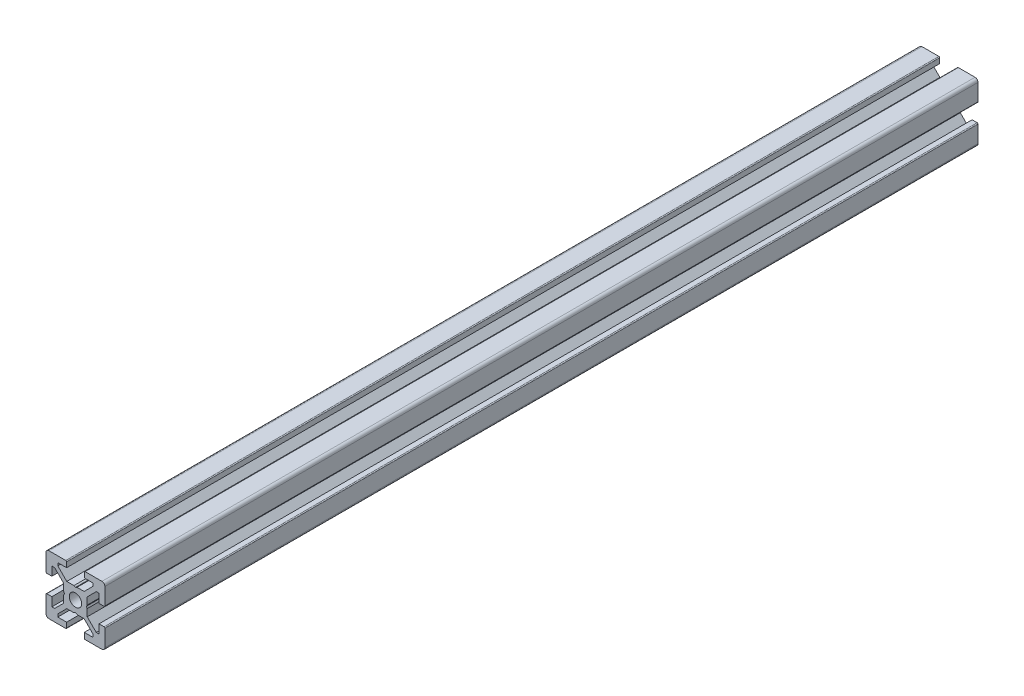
from build123d import *

# Parameters (mm, degrees)
BOSS_EXTRUDE1_DEPTH = 296.5
SKETCH2_W           = 355
SKETCH2_H           = 2.1


with BuildPart() as part:
    # Sketch1 → Boss-Extrude1 (new body)
    with BuildSketch(Plane.XY):
        with BuildLine():
            Line((-10, 9), (-10, 3.29999995))
            ThreePointArc((-10, 3.29999995), (-9.912132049, 3.087867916), (-9.7, 3))
            Line((-9.7, 3), (-8, 3))
            Line((-8, 3), (-8, 6))
            Line((-8, 6), (-7.060677, 6))
            Line((-7.060677, 6), (-4, 2.93932965))
            Line((-4, 2.93932965), (-4, 0.519615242))
            Line((-4, 0.519615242), (-3.699996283, -6.437e-06))
            Line((-3.699996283, -6.437e-06), (-4, -0.519628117))
            Line((-4, -0.519628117), (-4, -2.93933725))
            Line((-4, -2.93933725), (-7.0606695, -6))
            Line((-7.0606695, -6), (-8, -6))
            Line((-8, -6), (-8, -3))
            Line((-8, -3), (-9.7, -3))
            ThreePointArc((-9.7, -3), (-9.912132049, -3.087867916), (-10, -3.29999995))
            Line((-10, -3.29999995), (-10, -9))
            ThreePointArc((-10, -9), (-9.707106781, -9.707106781), (-9, -10))
            Line((-9, -10), (-3.29999995, -10))
            ThreePointArc((-3.29999995, -10), (-3.087867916, -9.912132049), (-3, -9.7))
            Line((-3, -9.7), (-3, -8))
            Line((-3, -8), (-6, -8))
            Line((-6, -8), (-6, -7.0606515))
            Line((-6, -7.0606515), (-2.9393489, -4))
            Line((-2.9393489, -4), (-0.519615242, -4))
            Line((-0.519615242, -4), (6.437e-06, -3.699996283))
            Line((6.437e-06, -3.699996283), (0.519628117, -4))
            Line((0.519628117, -4), (2.9393227, -4))
            Line((2.9393227, -4), (6, -7.060677))
            Line((6, -7.060677), (6, -8))
            Line((6, -8), (3, -8))
            Line((3, -8), (3, -9.7))
            ThreePointArc((3, -9.7), (3.087867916, -9.912132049), (3.29999995, -10))
            Line((3.29999995, -10), (9, -10))
            ThreePointArc((9, -10), (9.707106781, -9.707106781), (10, -9))
            Line((10, -9), (10, -3.29999995))
            ThreePointArc((10, -3.29999995), (9.912132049, -3.087867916), (9.7, -3))
            Line((9.7, -3), (8, -3))
            Line((8, -3), (8, -6))
            Line((8, -6), (7.0606435, -6))
            Line((7.0606435, -6), (4, -2.9393482))
            Line((4, -2.9393482), (4, -0.519615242))
            Line((4, -0.519615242), (3.699996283, 6.437e-06))
            Line((3.699996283, 6.437e-06), (4, 0.519628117))
            Line((4, 0.519628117), (4, 2.9393401))
            Line((4, 2.9393401), (7.060651, 6))
            Line((7.060651, 6), (8, 6))
            Line((8, 6), (8, 3))
            Line((8, 3), (9.7, 3))
            ThreePointArc((9.7, 3), (9.912132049, 3.087867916), (10, 3.29999995))
            Line((10, 3.29999995), (10, 9))
            ThreePointArc((10, 9), (9.707106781, 9.707106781), (9, 10))
            Line((9, 10), (3.29999995, 10))
            ThreePointArc((3.29999995, 10), (3.087867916, 9.912132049), (3, 9.7))
            Line((3, 9.7), (3, 8))
            Line((3, 8), (6, 8))
            Line((6, 8), (6, 7.060669))
            Line((6, 7.060669), (2.9393308, 4))
            Line((2.9393308, 4), (0.519615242, 4))
            Line((0.519615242, 4), (-6.437e-06, 3.699996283))
            Line((-6.437e-06, 3.699996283), (-0.519628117, 4))
            Line((-0.519628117, 4), (-2.93935655, 4))
            Line((-2.93935655, 4), (-6, 7.0606435))
            Line((-6, 7.0606435), (-6, 8))
            Line((-6, 8), (-3, 8))
            Line((-3, 8), (-3, 9.7))
            ThreePointArc((-3, 9.7), (-3.087867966, 9.912132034), (-3.3, 10))
            Line((-3.3, 10), (-9, 10))
            ThreePointArc((-9, 10), (-9.707106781, 9.707106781), (-10, 9))
        make_face()
    extrude(amount=-BOSS_EXTRUDE1_DEPTH)

    # Sketch2 → Cut-Revolve1 (revolve, cut)
    with BuildSketch(Plane(origin=(0, 0, 0), x_dir=(0, 0, -1), z_dir=(1, 0, 0)), mode=Mode.PRIVATE) as cut_revolve1_sk:
        with Locations((177.5, 1.05)):
            Rectangle(SKETCH2_W, SKETCH2_H)
    revolve(cut_revolve1_sk.sketch.rotate(Axis((0, 0, -355), (0, 0, 1)), 270), axis=Axis((0, 0, -355), (0, 0, 1)), mode=Mode.SUBTRACT)


solid = part.part
